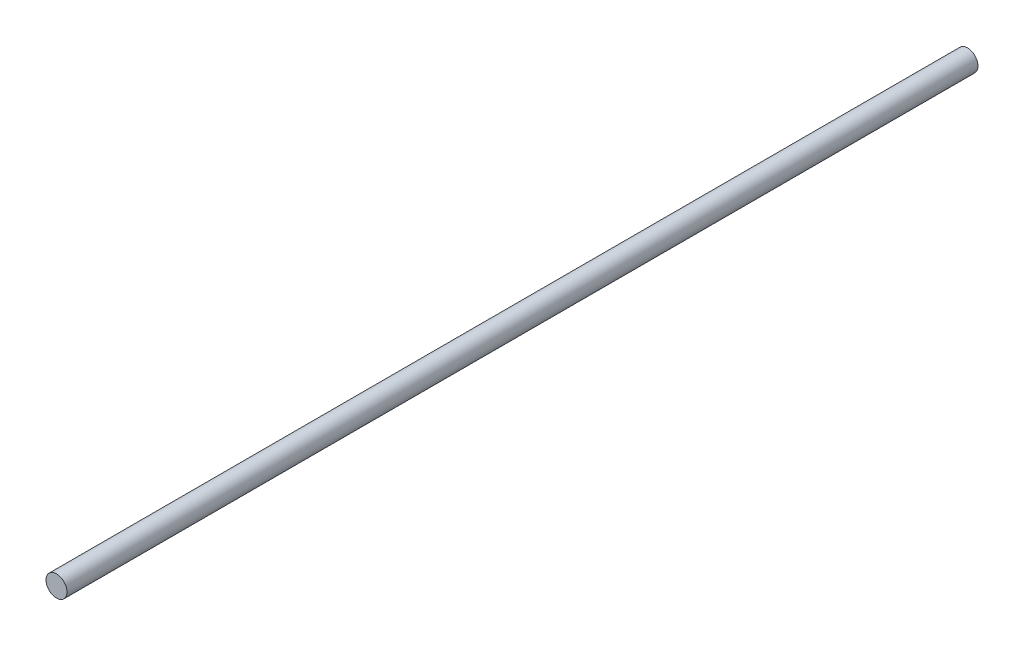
from build123d import *

# Parameters (mm, degrees)
SKETCH1_R           = 1.5
BOSS_EXTRUDE1_DEPTH = 65


with BuildPart() as part:
    # Sketch1 → Boss-Extrude1 (new, symmetric)
    with BuildSketch(Plane.XY):
        Circle(SKETCH1_R)
    extrude(amount=BOSS_EXTRUDE1_DEPTH, both=True)


solid = part.part
